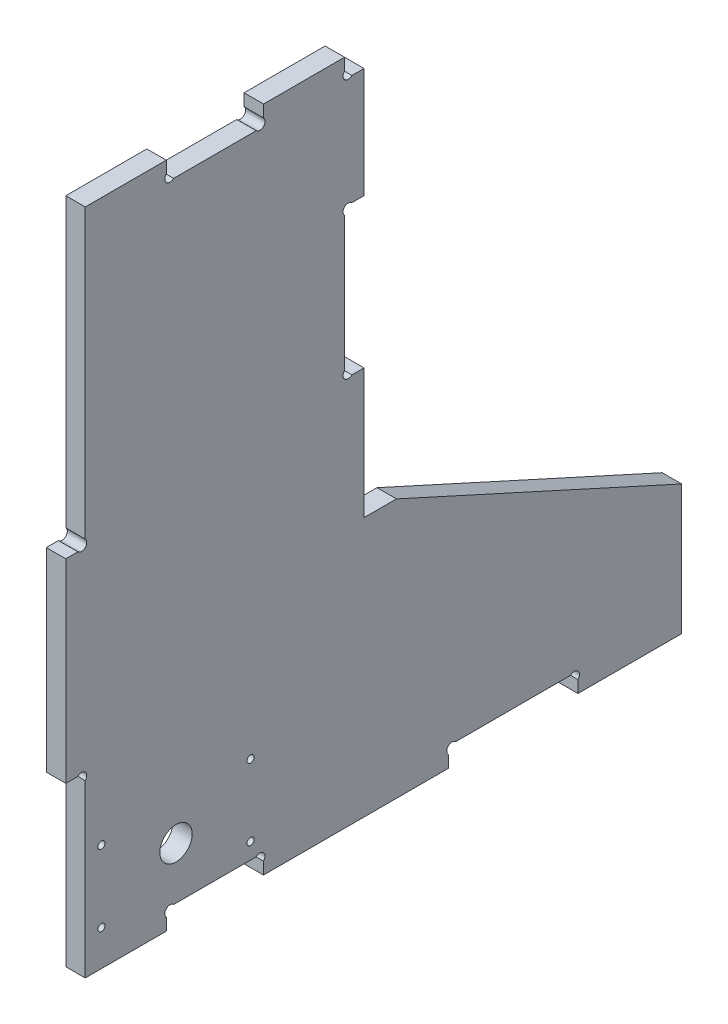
from build123d import *

# Parameters (mm, degrees)
ESQUISSE1_R        = 1.1
ESQUISSE1_R_2      = 5
BOSS_EXTRU_1_DEPTH = 6


with BuildPart() as part:
    # Esquisse1 → Boss.-Extru.1 (new body)
    with BuildSketch(Plane(origin=(0, 0, 0), x_dir=(0, 0, -1), z_dir=(1, 0, 0))):
        with BuildLine():
            Line((190, 40), (102, 80))
            Line((102, 80), (92, 80))
            Line((92, 80), (92, 120))
            Line((92, 120), (88.2627417, 120))
            ThreePointArc((88.2627417, 120), (86, 120), (86, 122.2627417))
            Line((86, 122.2627417), (86, 163.7372583))
            ThreePointArc((86, 163.7372583), (86, 166), (88.2627417, 166))
            Line((88.2627417, 166), (92, 166))
            Line((92, 166), (92, 200))
            Line((92, 200), (88.2627417, 200))
            ThreePointArc((88.2627417, 200), (86, 200), (86, 202.2627417))
            Line((86, 202.2627417), (86, 206))
            Line((86, 206), (61, 206))
            Line((61, 206), (61, 202.2627417))
            ThreePointArc((61, 202.2627417), (61, 200), (58.7372583, 200))
            Line((58.7372583, 200), (33.2627417, 200))
            ThreePointArc((33.2627417, 200), (31, 200), (31, 202.2627417))
            Line((31, 202.2627417), (31, 206))
            Line((31, 206), (6, 206))
            Line((6, 206), (6, 117.2627417))
            ThreePointArc((6, 117.2627417), (6, 115), (3.7372583, 115))
            Line((3.7372583, 115), (0, 115))
            Line((0, 115), (0, 55))
            Line((0, 55), (3.7372583, 55))
            ThreePointArc((3.7372583, 55), (6, 55), (6, 52.7372583))
            Line((6, 52.7372583), (6, 0))
            Line((6, 0), (31, 0))
            Line((31, 0), (31, 3.7372583))
            ThreePointArc((31, 3.7372583), (31, 6), (33.2627417, 6))
            Line((33.2627417, 6), (58.7372583, 6))
            ThreePointArc((58.7372583, 6), (61, 6), (61, 3.7372583))
            Line((61, 3.7372583), (61, 0))
            Line((61, 0), (118, 0))
            Line((118, 0), (118, 3.7372583))
            ThreePointArc((118, 3.7372583), (118, 6), (120.2627417, 6))
            Line((120.2627417, 6), (155.7372583, 6))
            ThreePointArc((155.7372583, 6), (158, 6), (158, 3.7372583))
            Line((158, 3.7372583), (158, 0))
            Line((158, 0), (190, 0))
            Line((190, 0), (190, 40))
        make_face()
        with Locations((11, 11)):
            Circle(ESQUISSE1_R, mode=Mode.SUBTRACT)
        with Locations(Location((57, 11, 0), (0, 0, 180))):
            Circle(ESQUISSE1_R, mode=Mode.SUBTRACT)
        with Locations((57, 33)):
            Circle(ESQUISSE1_R, mode=Mode.SUBTRACT)
        with Locations(Location((11, 33, 0), (0, 0, 180))):
            Circle(ESQUISSE1_R, mode=Mode.SUBTRACT)
        with Locations((34, 22)):
            Circle(ESQUISSE1_R_2, mode=Mode.SUBTRACT)
    extrude(amount=BOSS_EXTRU_1_DEPTH)


solid = part.part
